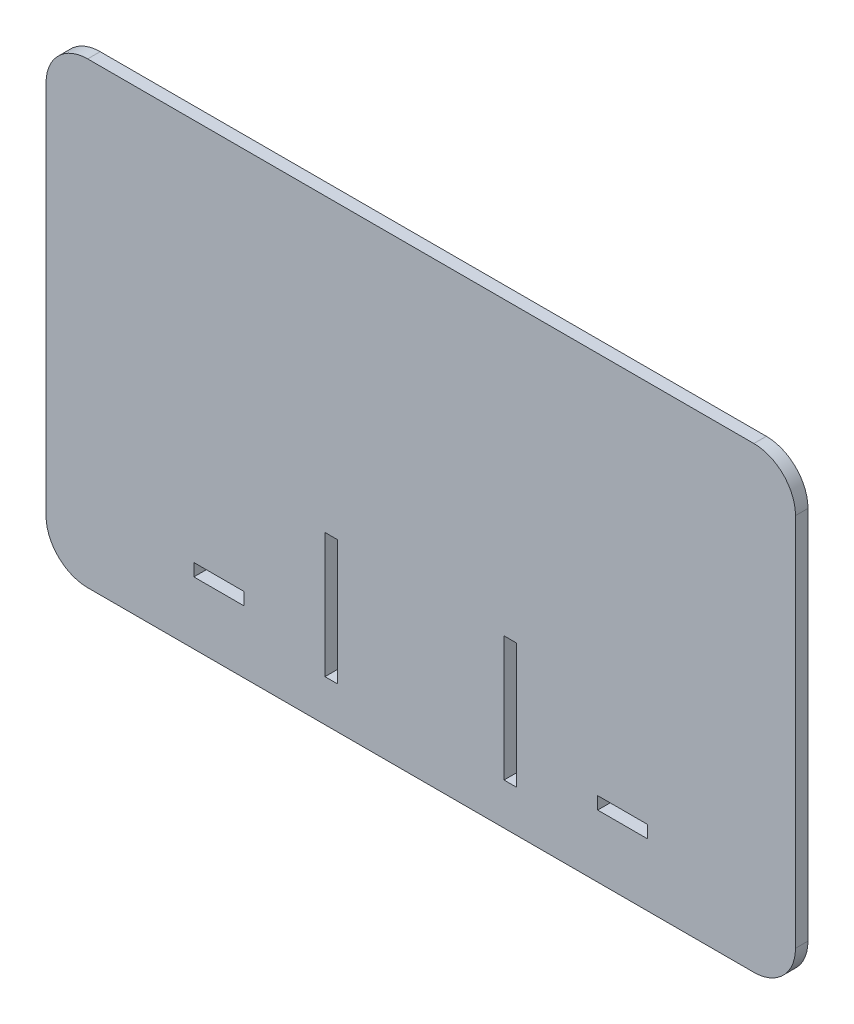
from build123d import *

# Parameters (mm, degrees)
ESQUISSE1_W        = 3
ESQUISSE1_H        = 30
ESQUISSE1_W_2      = 12
ESQUISSE1_H_2      = 3
BOSS_EXTRU_1_DEPTH = 3


with BuildPart() as part:
    # Esquisse1 → Boss.-Extru.1 (new body)
    with BuildSketch(Plane.XY):
        with BuildLine():
            Line((-58.416625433, 26.14009961), (101.583374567, 26.14009961))
            ThreePointArc((101.583374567, 26.14009961), (108.654442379, 23.211167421), (111.583374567, 16.14009961))
            Line((111.583374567, 16.14009961), (111.583374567, -73.85990039))
            ThreePointArc((111.583374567, -73.85990039), (108.654442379, -80.930968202), (101.583374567, -83.85990039))
            Line((101.583374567, -83.85990039), (-58.416625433, -83.85990039))
            ThreePointArc((-58.416625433, -83.85990039), (-65.487693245, -80.930968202), (-68.416625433, -73.85990039))
            Line((-68.416625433, -73.85990039), (-68.416625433, 16.14009961))
            ThreePointArc((-68.416625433, 16.14009961), (-65.487693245, 23.211167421), (-58.416625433, 26.14009961))
        make_face()
        with Locations((43.083374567, -58.85990039)):
            Rectangle(ESQUISSE1_W, ESQUISSE1_H, mode=Mode.SUBTRACT)
        with Locations((0.083374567, -58.85990039)):
            Rectangle(ESQUISSE1_W, ESQUISSE1_H, mode=Mode.SUBTRACT)
        with Locations((70.083374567, -67.35990039)):
            Rectangle(ESQUISSE1_W_2, ESQUISSE1_H_2, mode=Mode.SUBTRACT)
        with Locations((-26.916625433, -67.35990039)):
            Rectangle(ESQUISSE1_W_2, ESQUISSE1_H_2, mode=Mode.SUBTRACT)
    extrude(amount=BOSS_EXTRU_1_DEPTH)


solid = part.part
